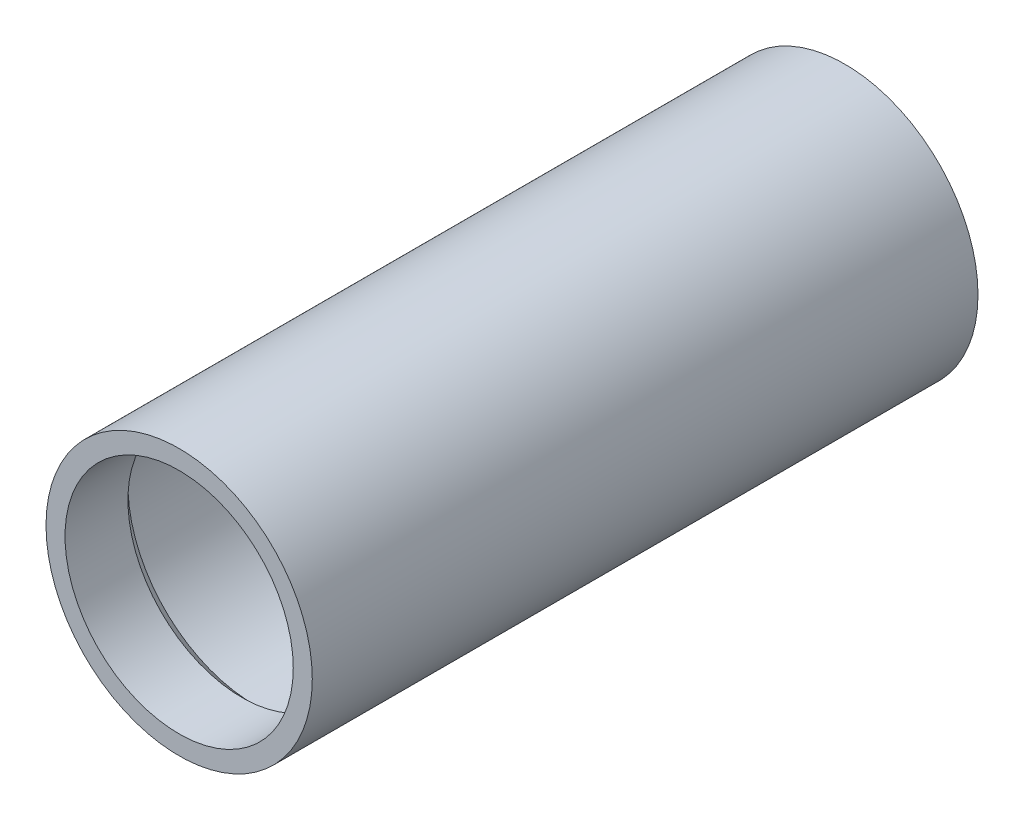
ISO-10303-21;
HEADER;
FILE_DESCRIPTION(('STEP AP214'),'2;1');
FILE_NAME('part.step','',(''),(''),'','','');
FILE_SCHEMA(('AUTOMOTIVE_DESIGN { 1 0 10303 214 1 1 1 1 }'));
ENDSEC;
DATA;
#1=APPLICATION_CONTEXT('core data for automotive mechanical design processes');
#2=APPLICATION_PROTOCOL_DEFINITION('international standard','automotive_design',2000,#1);
#3=PRODUCT_CONTEXT('',#1,'mechanical');
#4=PRODUCT('Part','Part','',(#3));
#5=PRODUCT_RELATED_PRODUCT_CATEGORY('part','',(#4));
#6=PRODUCT_DEFINITION_FORMATION('','',#4);
#7=PRODUCT_DEFINITION_CONTEXT('part definition',#1,'design');
#8=PRODUCT_DEFINITION('design','',#6,#7);
#9=PRODUCT_DEFINITION_SHAPE('','',#8);
#10=(LENGTH_UNIT() NAMED_UNIT(*) SI_UNIT(.MILLI.,.METRE.));
#11=(NAMED_UNIT(*) PLANE_ANGLE_UNIT() SI_UNIT($,.RADIAN.));
#12=(NAMED_UNIT(*) SI_UNIT($,.STERADIAN.) SOLID_ANGLE_UNIT());
#13=UNCERTAINTY_MEASURE_WITH_UNIT(LENGTH_MEASURE(1.E-05),#10,'distance_accuracy_value','');
#14=(GEOMETRIC_REPRESENTATION_CONTEXT(3) GLOBAL_UNCERTAINTY_ASSIGNED_CONTEXT((#13)) GLOBAL_UNIT_ASSIGNED_CONTEXT((#10,
#11,#12)) REPRESENTATION_CONTEXT('',''));
#15=CARTESIAN_POINT('',(0.,0.,0.));
#16=DIRECTION('',(0.,0.,1.));
#17=DIRECTION('',(1.,0.,0.));
#18=AXIS2_PLACEMENT_3D('',#15,#16,#17);
#19=CARTESIAN_POINT('',(0.,38.1,0.));
#20=DIRECTION('',(0.,0.,-1.));
#21=DIRECTION('',(-1.,0.,0.));
#22=AXIS2_PLACEMENT_3D('',#19,#20,#21);
#23=PLANE('',#22);
#24=CARTESIAN_POINT('',(0.,0.,0.));
#25=DIRECTION('',(0.,0.,1.));
#26=DIRECTION('',(1.,0.,0.));
#27=AXIS2_PLACEMENT_3D('',#24,#25,#26);
#28=CIRCLE('',#27,38.1);
#29=CARTESIAN_POINT('',(38.1,0.,0.));
#30=VERTEX_POINT('',#29);
#31=EDGE_CURVE('E60',#30,#30,#28,.T.);
#32=ORIENTED_EDGE('',*,*,#31,.F.);
#33=EDGE_LOOP('',(#32));
#34=FACE_BOUND('',#33,.T.);
#35=CARTESIAN_POINT('',(0.,0.,0.));
#36=DIRECTION('',(0.,0.,1.));
#37=DIRECTION('',(1.,0.,0.));
#38=AXIS2_PLACEMENT_3D('',#35,#36,#37);
#39=CIRCLE('',#38,44.45);
#40=CARTESIAN_POINT('',(44.45,0.,0.));
#41=VERTEX_POINT('',#40);
#42=EDGE_CURVE('E10',#41,#41,#39,.T.);
#43=ORIENTED_EDGE('',*,*,#42,.T.);
#44=EDGE_LOOP('',(#43));
#45=FACE_BOUND('',#44,.T.);
#46=ADVANCED_FACE('F32',(#34,#45),#23,.F.);
#47=CARTESIAN_POINT('',(0.,0.,0.));
#48=DIRECTION('',(0.,0.,1.));
#49=DIRECTION('',(1.,0.,0.));
#50=AXIS2_PLACEMENT_3D('',#47,#48,#49);
#51=CYLINDRICAL_SURFACE('',#50,44.45);
#52=ORIENTED_EDGE('',*,*,#42,.F.);
#53=EDGE_LOOP('',(#52));
#54=FACE_BOUND('',#53,.T.);
#55=CARTESIAN_POINT('',(0.,0.,-222.25));
#56=DIRECTION('',(0.,0.,1.));
#57=DIRECTION('',(1.,0.,0.));
#58=AXIS2_PLACEMENT_3D('',#55,#56,#57);
#59=CIRCLE('',#58,44.45);
#60=CARTESIAN_POINT('',(44.45,0.,-222.25));
#61=VERTEX_POINT('',#60);
#62=EDGE_CURVE('E38',#61,#61,#59,.T.);
#63=ORIENTED_EDGE('',*,*,#62,.T.);
#64=EDGE_LOOP('',(#63));
#65=FACE_BOUND('',#64,.T.);
#66=ADVANCED_FACE('F67',(#54,#65),#51,.T.);
#67=CARTESIAN_POINT('',(0.,44.45,-222.25));
#68=DIRECTION('',(0.,0.,1.));
#69=DIRECTION('',(1.,0.,0.));
#70=AXIS2_PLACEMENT_3D('',#67,#68,#69);
#71=PLANE('',#70);
#72=ORIENTED_EDGE('',*,*,#62,.F.);
#73=EDGE_LOOP('',(#72));
#74=FACE_BOUND('',#73,.T.);
#75=CARTESIAN_POINT('',(0.,0.,-222.25));
#76=DIRECTION('',(0.,0.,1.));
#77=DIRECTION('',(1.,0.,0.));
#78=AXIS2_PLACEMENT_3D('',#75,#76,#77);
#79=CIRCLE('',#78,38.1);
#80=CARTESIAN_POINT('',(38.1,0.,-222.25));
#81=VERTEX_POINT('',#80);
#82=EDGE_CURVE('E42',#81,#81,#79,.T.);
#83=ORIENTED_EDGE('',*,*,#82,.T.);
#84=EDGE_LOOP('',(#83));
#85=FACE_BOUND('',#84,.T.);
#86=ADVANCED_FACE('F71',(#74,#85),#71,.F.);
#87=CARTESIAN_POINT('',(0.,0.,0.));
#88=DIRECTION('',(0.,0.,1.));
#89=DIRECTION('',(1.,0.,0.));
#90=AXIS2_PLACEMENT_3D('',#87,#88,#89);
#91=CYLINDRICAL_SURFACE('',#90,38.1);
#92=ORIENTED_EDGE('',*,*,#82,.F.);
#93=EDGE_LOOP('',(#92));
#94=FACE_BOUND('',#93,.T.);
#95=CARTESIAN_POINT('',(0.,0.,-201.25));
#96=DIRECTION('',(0.,0.,1.));
#97=DIRECTION('',(1.,0.,0.));
#98=AXIS2_PLACEMENT_3D('',#95,#96,#97);
#99=CIRCLE('',#98,38.1);
#100=CARTESIAN_POINT('',(38.1,0.,-201.25));
#101=VERTEX_POINT('',#100);
#102=EDGE_CURVE('E46',#101,#101,#99,.T.);
#103=ORIENTED_EDGE('',*,*,#102,.T.);
#104=EDGE_LOOP('',(#103));
#105=FACE_BOUND('',#104,.T.);
#106=ADVANCED_FACE('F76',(#94,#105),#91,.F.);
#107=CARTESIAN_POINT('',(0.,0.,-196.9));
#108=DIRECTION('',(0.,0.,1.));
#109=DIRECTION('',(1.,0.,0.));
#110=AXIS2_PLACEMENT_3D('',#107,#108,#109);
#111=CONICAL_SURFACE('',#110,42.45,0.785398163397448);
#112=ORIENTED_EDGE('',*,*,#102,.F.);
#113=EDGE_LOOP('',(#112));
#114=FACE_BOUND('',#113,.T.);
#115=CARTESIAN_POINT('',(0.,0.,-196.9));
#116=DIRECTION('',(0.,0.,1.));
#117=DIRECTION('',(1.,0.,0.));
#118=AXIS2_PLACEMENT_3D('',#115,#116,#117);
#119=CIRCLE('',#118,42.45);
#120=CARTESIAN_POINT('',(42.45,0.,-196.9));
#121=VERTEX_POINT('',#120);
#122=EDGE_CURVE('E51',#121,#121,#119,.T.);
#123=ORIENTED_EDGE('',*,*,#122,.T.);
#124=EDGE_LOOP('',(#123));
#125=FACE_BOUND('',#124,.T.);
#126=ADVANCED_FACE('F82',(#114,#125),#111,.F.);
#127=CARTESIAN_POINT('',(0.,0.,0.));
#128=DIRECTION('',(0.,0.,1.));
#129=DIRECTION('',(1.,0.,0.));
#130=AXIS2_PLACEMENT_3D('',#127,#128,#129);
#131=CYLINDRICAL_SURFACE('',#130,42.45);
#132=ORIENTED_EDGE('',*,*,#122,.F.);
#133=EDGE_LOOP('',(#132));
#134=FACE_BOUND('',#133,.T.);
#135=CARTESIAN_POINT('',(0.,0.,-25.3499999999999));
#136=DIRECTION('',(0.,0.,1.));
#137=DIRECTION('',(1.,0.,0.));
#138=AXIS2_PLACEMENT_3D('',#135,#136,#137);
#139=CIRCLE('',#138,42.45);
#140=CARTESIAN_POINT('',(42.45,0.,-25.3499999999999));
#141=VERTEX_POINT('',#140);
#142=EDGE_CURVE('E54',#141,#141,#139,.T.);
#143=ORIENTED_EDGE('',*,*,#142,.T.);
#144=EDGE_LOOP('',(#143));
#145=FACE_BOUND('',#144,.T.);
#146=ADVANCED_FACE('F86',(#134,#145),#131,.F.);
#147=CARTESIAN_POINT('',(0.,0.,-21.));
#148=DIRECTION('',(0.,0.,-1.));
#149=DIRECTION('',(-1.,0.,0.));
#150=AXIS2_PLACEMENT_3D('',#147,#148,#149);
#151=CONICAL_SURFACE('',#150,38.1,0.785398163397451);
#152=ORIENTED_EDGE('',*,*,#142,.F.);
#153=EDGE_LOOP('',(#152));
#154=FACE_BOUND('',#153,.T.);
#155=CARTESIAN_POINT('',(0.,0.,-21.));
#156=DIRECTION('',(0.,0.,1.));
#157=DIRECTION('',(1.,0.,0.));
#158=AXIS2_PLACEMENT_3D('',#155,#156,#157);
#159=CIRCLE('',#158,38.1);
#160=CARTESIAN_POINT('',(38.1,0.,-21.));
#161=VERTEX_POINT('',#160);
#162=EDGE_CURVE('E57',#161,#161,#159,.T.);
#163=ORIENTED_EDGE('',*,*,#162,.T.);
#164=EDGE_LOOP('',(#163));
#165=FACE_BOUND('',#164,.T.);
#166=ADVANCED_FACE('F90',(#154,#165),#151,.F.);
#167=CARTESIAN_POINT('',(0.,0.,0.));
#168=DIRECTION('',(0.,0.,1.));
#169=DIRECTION('',(1.,0.,0.));
#170=AXIS2_PLACEMENT_3D('',#167,#168,#169);
#171=CYLINDRICAL_SURFACE('',#170,38.1);
#172=ORIENTED_EDGE('',*,*,#162,.F.);
#173=EDGE_LOOP('',(#172));
#174=FACE_BOUND('',#173,.T.);
#175=ORIENTED_EDGE('',*,*,#31,.T.);
#176=EDGE_LOOP('',(#175));
#177=FACE_BOUND('',#176,.T.);
#178=ADVANCED_FACE('F64',(#174,#177),#171,.F.);
#179=CLOSED_SHELL('',(#46,#66,#86,#106,#126,#146,#166,#178));
#180=MANIFOLD_SOLID_BREP('B2',#179);
#181=ADVANCED_BREP_SHAPE_REPRESENTATION('',(#18,#180),#14);
#182=SHAPE_DEFINITION_REPRESENTATION(#9,#181);
ENDSEC;
END-ISO-10303-21;
